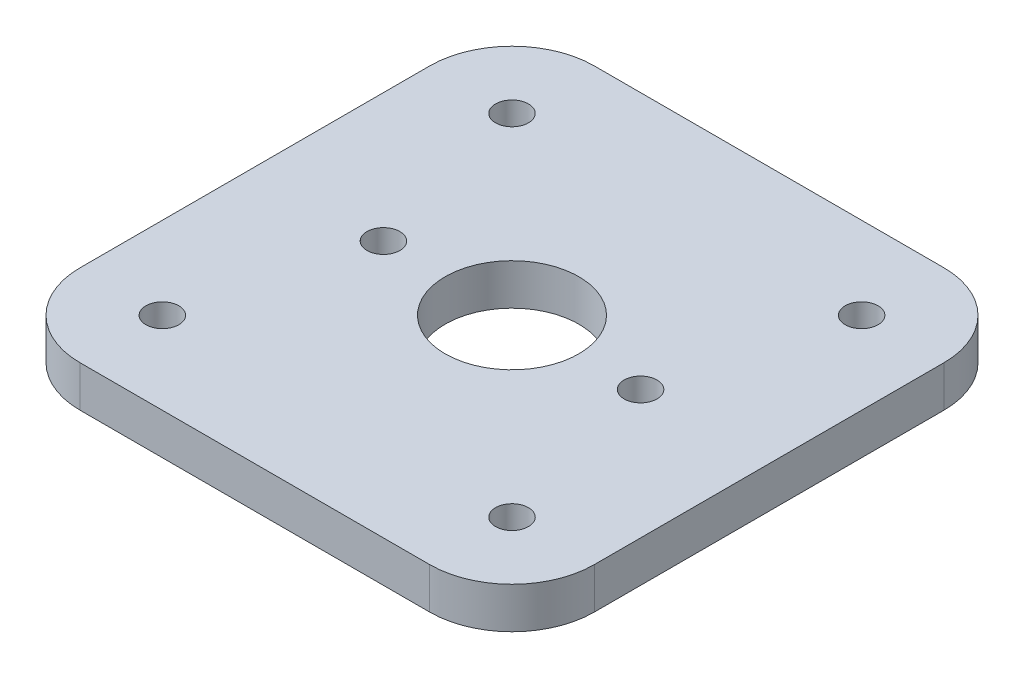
ISO-10303-21;
HEADER;
FILE_DESCRIPTION(('STEP AP214'),'2;1');
FILE_NAME('part.step','',(''),(''),'','','');
FILE_SCHEMA(('AUTOMOTIVE_DESIGN { 1 0 10303 214 1 1 1 1 }'));
ENDSEC;
DATA;
#1=APPLICATION_CONTEXT('core data for automotive mechanical design processes');
#2=APPLICATION_PROTOCOL_DEFINITION('international standard','automotive_design',2000,#1);
#3=PRODUCT_CONTEXT('',#1,'mechanical');
#4=PRODUCT('Part','Part','',(#3));
#5=PRODUCT_RELATED_PRODUCT_CATEGORY('part','',(#4));
#6=PRODUCT_DEFINITION_FORMATION('','',#4);
#7=PRODUCT_DEFINITION_CONTEXT('part definition',#1,'design');
#8=PRODUCT_DEFINITION('design','',#6,#7);
#9=PRODUCT_DEFINITION_SHAPE('','',#8);
#10=(LENGTH_UNIT() NAMED_UNIT(*) SI_UNIT(.MILLI.,.METRE.));
#11=(NAMED_UNIT(*) PLANE_ANGLE_UNIT() SI_UNIT($,.RADIAN.));
#12=(NAMED_UNIT(*) SI_UNIT($,.STERADIAN.) SOLID_ANGLE_UNIT());
#13=UNCERTAINTY_MEASURE_WITH_UNIT(LENGTH_MEASURE(1.E-05),#10,'distance_accuracy_value','');
#14=(GEOMETRIC_REPRESENTATION_CONTEXT(3) GLOBAL_UNCERTAINTY_ASSIGNED_CONTEXT((#13)) GLOBAL_UNIT_ASSIGNED_CONTEXT((#10,
#11,#12)) REPRESENTATION_CONTEXT('',''));
#15=CARTESIAN_POINT('',(0.,0.,0.));
#16=DIRECTION('',(0.,0.,1.));
#17=DIRECTION('',(1.,0.,0.));
#18=AXIS2_PLACEMENT_3D('',#15,#16,#17);
#19=CARTESIAN_POINT('',(-17.,4.,17.));
#20=DIRECTION('',(0.,1.,0.));
#21=DIRECTION('',(0.,0.,1.));
#22=AXIS2_PLACEMENT_3D('',#19,#20,#21);
#23=PLANE('',#22);
#24=CARTESIAN_POINT('',(-17.,4.,17.));
#25=DIRECTION('',(0.,1.,0.));
#26=DIRECTION('',(0.,0.,-1.));
#27=AXIS2_PLACEMENT_3D('',#24,#25,#26);
#28=CIRCLE('',#27,1.59999999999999);
#29=CARTESIAN_POINT('',(-17.,4.,15.4));
#30=VERTEX_POINT('',#29);
#31=EDGE_CURVE('E206',#30,#30,#28,.T.);
#32=ORIENTED_EDGE('',*,*,#31,.F.);
#33=EDGE_LOOP('',(#32));
#34=FACE_BOUND('',#33,.T.);
#35=CARTESIAN_POINT('',(-17.,4.,-17.));
#36=DIRECTION('',(0.,1.,0.));
#37=DIRECTION('',(0.,0.,1.));
#38=AXIS2_PLACEMENT_3D('',#35,#36,#37);
#39=CIRCLE('',#38,1.6);
#40=CARTESIAN_POINT('',(-17.,4.,-15.4));
#41=VERTEX_POINT('',#40);
#42=EDGE_CURVE('E194',#41,#41,#39,.T.);
#43=ORIENTED_EDGE('',*,*,#42,.F.);
#44=EDGE_LOOP('',(#43));
#45=FACE_BOUND('',#44,.T.);
#46=CARTESIAN_POINT('',(-12.5,4.,0.));
#47=DIRECTION('',(0.,1.,0.));
#48=DIRECTION('',(0.,0.,1.));
#49=AXIS2_PLACEMENT_3D('',#46,#47,#48);
#50=CIRCLE('',#49,1.6);
#51=CARTESIAN_POINT('',(-12.5,4.,1.6));
#52=VERTEX_POINT('',#51);
#53=EDGE_CURVE('E182',#52,#52,#50,.T.);
#54=ORIENTED_EDGE('',*,*,#53,.F.);
#55=EDGE_LOOP('',(#54));
#56=FACE_BOUND('',#55,.T.);
#57=CARTESIAN_POINT('',(-17.,4.,17.));
#58=DIRECTION('',(0.,1.,0.));
#59=DIRECTION('',(0.,0.,1.));
#60=AXIS2_PLACEMENT_3D('',#57,#58,#59);
#61=CIRCLE('',#60,8.);
#62=CARTESIAN_POINT('',(-25.,4.,17.));
#63=VERTEX_POINT('',#62);
#64=CARTESIAN_POINT('',(-17.,4.,25.));
#65=VERTEX_POINT('',#64);
#66=EDGE_CURVE('E145',#63,#65,#61,.T.);
#67=ORIENTED_EDGE('',*,*,#66,.T.);
#68=DIRECTION('',(1.,0.,0.));
#69=VECTOR('',#68,1.);
#70=CARTESIAN_POINT('',(-17.,4.,25.));
#71=LINE('',#70,#69);
#72=CARTESIAN_POINT('',(17.,4.,25.));
#73=VERTEX_POINT('',#72);
#74=EDGE_CURVE('E93',#65,#73,#71,.T.);
#75=ORIENTED_EDGE('',*,*,#74,.T.);
#76=CARTESIAN_POINT('',(17.,4.,17.));
#77=DIRECTION('',(0.,1.,0.));
#78=DIRECTION('',(0.,0.,1.));
#79=AXIS2_PLACEMENT_3D('',#76,#77,#78);
#80=CIRCLE('',#79,8.);
#81=CARTESIAN_POINT('',(25.,4.,17.));
#82=VERTEX_POINT('',#81);
#83=EDGE_CURVE('E160',#73,#82,#80,.T.);
#84=ORIENTED_EDGE('',*,*,#83,.T.);
#85=DIRECTION('',(0.,0.,-1.));
#86=VECTOR('',#85,1.);
#87=CARTESIAN_POINT('',(25.,4.,-17.));
#88=LINE('',#87,#86);
#89=CARTESIAN_POINT('',(25.,4.,-17.));
#90=VERTEX_POINT('',#89);
#91=EDGE_CURVE('E173',#82,#90,#88,.T.);
#92=ORIENTED_EDGE('',*,*,#91,.T.);
#93=CARTESIAN_POINT('',(17.,4.,-17.));
#94=DIRECTION('',(0.,1.,0.));
#95=DIRECTION('',(0.,0.,-1.));
#96=AXIS2_PLACEMENT_3D('',#93,#94,#95);
#97=CIRCLE('',#96,8.);
#98=CARTESIAN_POINT('',(17.,4.,-25.));
#99=VERTEX_POINT('',#98);
#100=EDGE_CURVE('E112',#90,#99,#97,.T.);
#101=ORIENTED_EDGE('',*,*,#100,.T.);
#102=DIRECTION('',(-1.,0.,0.));
#103=VECTOR('',#102,1.);
#104=CARTESIAN_POINT('',(-17.,4.,-25.));
#105=LINE('',#104,#103);
#106=CARTESIAN_POINT('',(-17.,4.,-25.));
#107=VERTEX_POINT('',#106);
#108=EDGE_CURVE('E106',#99,#107,#105,.T.);
#109=ORIENTED_EDGE('',*,*,#108,.T.);
#110=CARTESIAN_POINT('',(-17.,4.,-17.));
#111=DIRECTION('',(0.,1.,0.));
#112=DIRECTION('',(0.,0.,1.));
#113=AXIS2_PLACEMENT_3D('',#110,#111,#112);
#114=CIRCLE('',#113,8.);
#115=CARTESIAN_POINT('',(-25.,4.,-17.));
#116=VERTEX_POINT('',#115);
#117=EDGE_CURVE('E110',#107,#116,#114,.T.);
#118=ORIENTED_EDGE('',*,*,#117,.T.);
#119=DIRECTION('',(0.,0.,1.));
#120=VECTOR('',#119,1.);
#121=CARTESIAN_POINT('',(-25.,4.,-17.));
#122=LINE('',#121,#120);
#123=EDGE_CURVE('E50',#116,#63,#122,.T.);
#124=ORIENTED_EDGE('',*,*,#123,.T.);
#125=EDGE_LOOP('',(#67,#75,#84,#92,#101,#109,#118,#124));
#126=FACE_BOUND('',#125,.T.);
#127=CARTESIAN_POINT('',(0.,4.,0.));
#128=DIRECTION('',(0.,1.,0.));
#129=DIRECTION('',(0.,0.,1.));
#130=AXIS2_PLACEMENT_3D('',#127,#128,#129);
#131=CIRCLE('',#130,6.5);
#132=CARTESIAN_POINT('',(0.,4.,6.5));
#133=VERTEX_POINT('',#132);
#134=EDGE_CURVE('E134',#133,#133,#131,.T.);
#135=ORIENTED_EDGE('',*,*,#134,.F.);
#136=EDGE_LOOP('',(#135));
#137=FACE_BOUND('',#136,.T.);
#138=CARTESIAN_POINT('',(12.5,4.,0.));
#139=DIRECTION('',(0.,1.,0.));
#140=DIRECTION('',(0.,0.,-1.));
#141=AXIS2_PLACEMENT_3D('',#138,#139,#140);
#142=CIRCLE('',#141,1.6);
#143=CARTESIAN_POINT('',(12.5,4.,-1.6));
#144=VERTEX_POINT('',#143);
#145=EDGE_CURVE('E188',#144,#144,#142,.T.);
#146=ORIENTED_EDGE('',*,*,#145,.F.);
#147=EDGE_LOOP('',(#146));
#148=FACE_BOUND('',#147,.T.);
#149=CARTESIAN_POINT('',(17.,4.,-17.));
#150=DIRECTION('',(0.,1.,0.));
#151=DIRECTION('',(0.,0.,-1.));
#152=AXIS2_PLACEMENT_3D('',#149,#150,#151);
#153=CIRCLE('',#152,1.60000000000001);
#154=CARTESIAN_POINT('',(17.,4.,-18.6));
#155=VERTEX_POINT('',#154);
#156=EDGE_CURVE('E200',#155,#155,#153,.T.);
#157=ORIENTED_EDGE('',*,*,#156,.F.);
#158=EDGE_LOOP('',(#157));
#159=FACE_BOUND('',#158,.T.);
#160=CARTESIAN_POINT('',(17.,4.,17.));
#161=DIRECTION('',(0.,1.,0.));
#162=DIRECTION('',(0.,0.,1.));
#163=AXIS2_PLACEMENT_3D('',#160,#161,#162);
#164=CIRCLE('',#163,1.60000000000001);
#165=CARTESIAN_POINT('',(17.,4.,18.6));
#166=VERTEX_POINT('',#165);
#167=EDGE_CURVE('E212',#166,#166,#164,.T.);
#168=ORIENTED_EDGE('',*,*,#167,.F.);
#169=EDGE_LOOP('',(#168));
#170=FACE_BOUND('',#169,.T.);
#171=ADVANCED_FACE('F33',(#34,#45,#56,#126,#137,#148,#159,#170),#23,.T.);
#172=CARTESIAN_POINT('',(-17.,0.,17.));
#173=DIRECTION('',(0.,1.,0.));
#174=DIRECTION('',(0.,0.,1.));
#175=AXIS2_PLACEMENT_3D('',#172,#173,#174);
#176=PLANE('',#175);
#177=CARTESIAN_POINT('',(-17.,0.,17.));
#178=DIRECTION('',(0.,1.,0.));
#179=DIRECTION('',(0.,0.,-1.));
#180=AXIS2_PLACEMENT_3D('',#177,#178,#179);
#181=CIRCLE('',#180,1.59999999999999);
#182=CARTESIAN_POINT('',(-17.,0.,15.4));
#183=VERTEX_POINT('',#182);
#184=EDGE_CURVE('E209',#183,#183,#181,.T.);
#185=ORIENTED_EDGE('',*,*,#184,.T.);
#186=EDGE_LOOP('',(#185));
#187=FACE_BOUND('',#186,.T.);
#188=CARTESIAN_POINT('',(-17.,0.,-17.));
#189=DIRECTION('',(0.,1.,0.));
#190=DIRECTION('',(0.,0.,1.));
#191=AXIS2_PLACEMENT_3D('',#188,#189,#190);
#192=CIRCLE('',#191,1.6);
#193=CARTESIAN_POINT('',(-17.,0.,-15.4));
#194=VERTEX_POINT('',#193);
#195=EDGE_CURVE('E197',#194,#194,#192,.T.);
#196=ORIENTED_EDGE('',*,*,#195,.T.);
#197=EDGE_LOOP('',(#196));
#198=FACE_BOUND('',#197,.T.);
#199=CARTESIAN_POINT('',(-12.5,0.,0.));
#200=DIRECTION('',(0.,1.,0.));
#201=DIRECTION('',(0.,0.,1.));
#202=AXIS2_PLACEMENT_3D('',#199,#200,#201);
#203=CIRCLE('',#202,1.6);
#204=CARTESIAN_POINT('',(-12.5,0.,1.6));
#205=VERTEX_POINT('',#204);
#206=EDGE_CURVE('E185',#205,#205,#203,.T.);
#207=ORIENTED_EDGE('',*,*,#206,.T.);
#208=EDGE_LOOP('',(#207));
#209=FACE_BOUND('',#208,.T.);
#210=CARTESIAN_POINT('',(-17.,0.,17.));
#211=DIRECTION('',(0.,1.,0.));
#212=DIRECTION('',(0.,0.,1.));
#213=AXIS2_PLACEMENT_3D('',#210,#211,#212);
#214=CIRCLE('',#213,8.);
#215=CARTESIAN_POINT('',(-25.,0.,17.));
#216=VERTEX_POINT('',#215);
#217=CARTESIAN_POINT('',(-17.,0.,25.));
#218=VERTEX_POINT('',#217);
#219=EDGE_CURVE('E130',#216,#218,#214,.T.);
#220=ORIENTED_EDGE('',*,*,#219,.F.);
#221=DIRECTION('',(0.,0.,1.));
#222=VECTOR('',#221,1.);
#223=CARTESIAN_POINT('',(-25.,0.,-17.));
#224=LINE('',#223,#222);
#225=CARTESIAN_POINT('',(-25.,0.,-17.));
#226=VERTEX_POINT('',#225);
#227=EDGE_CURVE('E85',#226,#216,#224,.T.);
#228=ORIENTED_EDGE('',*,*,#227,.F.);
#229=CARTESIAN_POINT('',(-17.,0.,-17.));
#230=DIRECTION('',(0.,1.,0.));
#231=DIRECTION('',(0.,0.,1.));
#232=AXIS2_PLACEMENT_3D('',#229,#230,#231);
#233=CIRCLE('',#232,8.);
#234=CARTESIAN_POINT('',(-17.,0.,-25.));
#235=VERTEX_POINT('',#234);
#236=EDGE_CURVE('E79',#235,#226,#233,.T.);
#237=ORIENTED_EDGE('',*,*,#236,.F.);
#238=DIRECTION('',(-1.,0.,0.));
#239=VECTOR('',#238,1.);
#240=CARTESIAN_POINT('',(-17.,0.,-25.));
#241=LINE('',#240,#239);
#242=CARTESIAN_POINT('',(17.,0.,-25.));
#243=VERTEX_POINT('',#242);
#244=EDGE_CURVE('E120',#243,#235,#241,.T.);
#245=ORIENTED_EDGE('',*,*,#244,.F.);
#246=CARTESIAN_POINT('',(17.,0.,-17.));
#247=DIRECTION('',(0.,1.,0.));
#248=DIRECTION('',(0.,0.,-1.));
#249=AXIS2_PLACEMENT_3D('',#246,#247,#248);
#250=CIRCLE('',#249,8.);
#251=CARTESIAN_POINT('',(25.,0.,-17.));
#252=VERTEX_POINT('',#251);
#253=EDGE_CURVE('E140',#252,#243,#250,.T.);
#254=ORIENTED_EDGE('',*,*,#253,.F.);
#255=DIRECTION('',(0.,0.,-1.));
#256=VECTOR('',#255,1.);
#257=CARTESIAN_POINT('',(25.,0.,-17.));
#258=LINE('',#257,#256);
#259=CARTESIAN_POINT('',(25.,0.,17.));
#260=VERTEX_POINT('',#259);
#261=EDGE_CURVE('E138',#260,#252,#258,.T.);
#262=ORIENTED_EDGE('',*,*,#261,.F.);
#263=CARTESIAN_POINT('',(17.,0.,17.));
#264=DIRECTION('',(0.,1.,0.));
#265=DIRECTION('',(0.,0.,1.));
#266=AXIS2_PLACEMENT_3D('',#263,#264,#265);
#267=CIRCLE('',#266,8.);
#268=CARTESIAN_POINT('',(17.,0.,25.));
#269=VERTEX_POINT('',#268);
#270=EDGE_CURVE('E136',#269,#260,#267,.T.);
#271=ORIENTED_EDGE('',*,*,#270,.F.);
#272=DIRECTION('',(1.,0.,0.));
#273=VECTOR('',#272,1.);
#274=CARTESIAN_POINT('',(-17.,0.,25.));
#275=LINE('',#274,#273);
#276=EDGE_CURVE('E133',#218,#269,#275,.T.);
#277=ORIENTED_EDGE('',*,*,#276,.F.);
#278=EDGE_LOOP('',(#220,#228,#237,#245,#254,#262,#271,#277));
#279=FACE_BOUND('',#278,.T.);
#280=CARTESIAN_POINT('',(0.,0.,0.));
#281=DIRECTION('',(0.,1.,0.));
#282=DIRECTION('',(0.,0.,1.));
#283=AXIS2_PLACEMENT_3D('',#280,#281,#282);
#284=CIRCLE('',#283,6.5);
#285=CARTESIAN_POINT('',(0.,0.,6.5));
#286=VERTEX_POINT('',#285);
#287=EDGE_CURVE('E179',#286,#286,#284,.T.);
#288=ORIENTED_EDGE('',*,*,#287,.T.);
#289=EDGE_LOOP('',(#288));
#290=FACE_BOUND('',#289,.T.);
#291=CARTESIAN_POINT('',(12.5,0.,0.));
#292=DIRECTION('',(0.,1.,0.));
#293=DIRECTION('',(0.,0.,-1.));
#294=AXIS2_PLACEMENT_3D('',#291,#292,#293);
#295=CIRCLE('',#294,1.6);
#296=CARTESIAN_POINT('',(12.5,0.,-1.6));
#297=VERTEX_POINT('',#296);
#298=EDGE_CURVE('E191',#297,#297,#295,.T.);
#299=ORIENTED_EDGE('',*,*,#298,.T.);
#300=EDGE_LOOP('',(#299));
#301=FACE_BOUND('',#300,.T.);
#302=CARTESIAN_POINT('',(17.,0.,-17.));
#303=DIRECTION('',(0.,1.,0.));
#304=DIRECTION('',(0.,0.,-1.));
#305=AXIS2_PLACEMENT_3D('',#302,#303,#304);
#306=CIRCLE('',#305,1.60000000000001);
#307=CARTESIAN_POINT('',(17.,0.,-18.6));
#308=VERTEX_POINT('',#307);
#309=EDGE_CURVE('E203',#308,#308,#306,.T.);
#310=ORIENTED_EDGE('',*,*,#309,.T.);
#311=EDGE_LOOP('',(#310));
#312=FACE_BOUND('',#311,.T.);
#313=CARTESIAN_POINT('',(17.,0.,17.));
#314=DIRECTION('',(0.,1.,0.));
#315=DIRECTION('',(0.,0.,1.));
#316=AXIS2_PLACEMENT_3D('',#313,#314,#315);
#317=CIRCLE('',#316,1.60000000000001);
#318=CARTESIAN_POINT('',(17.,0.,18.6));
#319=VERTEX_POINT('',#318);
#320=EDGE_CURVE('E215',#319,#319,#317,.T.);
#321=ORIENTED_EDGE('',*,*,#320,.T.);
#322=EDGE_LOOP('',(#321));
#323=FACE_BOUND('',#322,.T.);
#324=ADVANCED_FACE('F164',(#187,#198,#209,#279,#290,#301,#312,#323),#176,.F.);
#325=CARTESIAN_POINT('',(-17.,4.,17.));
#326=DIRECTION('',(0.,-1.,0.));
#327=DIRECTION('',(0.,0.,-1.));
#328=AXIS2_PLACEMENT_3D('',#325,#326,#327);
#329=CYLINDRICAL_SURFACE('',#328,8.);
#330=ORIENTED_EDGE('',*,*,#219,.T.);
#331=DIRECTION('',(0.,-1.,0.));
#332=VECTOR('',#331,1.);
#333=CARTESIAN_POINT('',(-17.,4.,25.));
#334=LINE('',#333,#332);
#335=EDGE_CURVE('E11',#65,#218,#334,.T.);
#336=ORIENTED_EDGE('',*,*,#335,.F.);
#337=ORIENTED_EDGE('',*,*,#66,.F.);
#338=DIRECTION('',(0.,-1.,0.));
#339=VECTOR('',#338,1.);
#340=CARTESIAN_POINT('',(-25.,4.,17.));
#341=LINE('',#340,#339);
#342=EDGE_CURVE('E126',#63,#216,#341,.T.);
#343=ORIENTED_EDGE('',*,*,#342,.T.);
#344=EDGE_LOOP('',(#330,#336,#337,#343));
#345=FACE_BOUND('',#344,.T.);
#346=ADVANCED_FACE('F35',(#345),#329,.T.);
#347=CARTESIAN_POINT('',(-17.,4.,25.));
#348=DIRECTION('',(0.,0.,-1.));
#349=DIRECTION('',(-1.,0.,0.));
#350=AXIS2_PLACEMENT_3D('',#347,#348,#349);
#351=PLANE('',#350);
#352=ORIENTED_EDGE('',*,*,#276,.T.);
#353=DIRECTION('',(0.,-1.,0.));
#354=VECTOR('',#353,1.);
#355=CARTESIAN_POINT('',(17.,4.,25.));
#356=LINE('',#355,#354);
#357=EDGE_CURVE('E42',#73,#269,#356,.T.);
#358=ORIENTED_EDGE('',*,*,#357,.F.);
#359=ORIENTED_EDGE('',*,*,#74,.F.);
#360=ORIENTED_EDGE('',*,*,#335,.T.);
#361=EDGE_LOOP('',(#352,#358,#359,#360));
#362=FACE_BOUND('',#361,.T.);
#363=ADVANCED_FACE('F250',(#362),#351,.F.);
#364=CARTESIAN_POINT('',(17.,4.,17.));
#365=DIRECTION('',(0.,-1.,0.));
#366=DIRECTION('',(0.,0.,-1.));
#367=AXIS2_PLACEMENT_3D('',#364,#365,#366);
#368=CYLINDRICAL_SURFACE('',#367,8.);
#369=ORIENTED_EDGE('',*,*,#270,.T.);
#370=DIRECTION('',(0.,-1.,0.));
#371=VECTOR('',#370,1.);
#372=CARTESIAN_POINT('',(25.,4.,17.));
#373=LINE('',#372,#371);
#374=EDGE_CURVE('E152',#82,#260,#373,.T.);
#375=ORIENTED_EDGE('',*,*,#374,.F.);
#376=ORIENTED_EDGE('',*,*,#83,.F.);
#377=ORIENTED_EDGE('',*,*,#357,.T.);
#378=EDGE_LOOP('',(#369,#375,#376,#377));
#379=FACE_BOUND('',#378,.T.);
#380=ADVANCED_FACE('F158',(#379),#368,.T.);
#381=CARTESIAN_POINT('',(25.,4.,-17.));
#382=DIRECTION('',(-1.,0.,0.));
#383=DIRECTION('',(0.,0.,1.));
#384=AXIS2_PLACEMENT_3D('',#381,#382,#383);
#385=PLANE('',#384);
#386=ORIENTED_EDGE('',*,*,#261,.T.);
#387=DIRECTION('',(0.,-1.,0.));
#388=VECTOR('',#387,1.);
#389=CARTESIAN_POINT('',(25.,4.,-17.));
#390=LINE('',#389,#388);
#391=EDGE_CURVE('E149',#90,#252,#390,.T.);
#392=ORIENTED_EDGE('',*,*,#391,.F.);
#393=ORIENTED_EDGE('',*,*,#91,.F.);
#394=ORIENTED_EDGE('',*,*,#374,.T.);
#395=EDGE_LOOP('',(#386,#392,#393,#394));
#396=FACE_BOUND('',#395,.T.);
#397=ADVANCED_FACE('F169',(#396),#385,.F.);
#398=CARTESIAN_POINT('',(17.,4.,-17.));
#399=DIRECTION('',(0.,-1.,0.));
#400=DIRECTION('',(0.,0.,-1.));
#401=AXIS2_PLACEMENT_3D('',#398,#399,#400);
#402=CYLINDRICAL_SURFACE('',#401,8.);
#403=ORIENTED_EDGE('',*,*,#253,.T.);
#404=DIRECTION('',(0.,-1.,0.));
#405=VECTOR('',#404,1.);
#406=CARTESIAN_POINT('',(17.,4.,-25.));
#407=LINE('',#406,#405);
#408=EDGE_CURVE('E121',#99,#243,#407,.T.);
#409=ORIENTED_EDGE('',*,*,#408,.F.);
#410=ORIENTED_EDGE('',*,*,#100,.F.);
#411=ORIENTED_EDGE('',*,*,#391,.T.);
#412=EDGE_LOOP('',(#403,#409,#410,#411));
#413=FACE_BOUND('',#412,.T.);
#414=ADVANCED_FACE('F172',(#413),#402,.T.);
#415=CARTESIAN_POINT('',(-17.,4.,-25.));
#416=DIRECTION('',(0.,0.,1.));
#417=DIRECTION('',(1.,0.,0.));
#418=AXIS2_PLACEMENT_3D('',#415,#416,#417);
#419=PLANE('',#418);
#420=ORIENTED_EDGE('',*,*,#244,.T.);
#421=DIRECTION('',(0.,-1.,0.));
#422=VECTOR('',#421,1.);
#423=CARTESIAN_POINT('',(-17.,4.,-25.));
#424=LINE('',#423,#422);
#425=EDGE_CURVE('E117',#107,#235,#424,.T.);
#426=ORIENTED_EDGE('',*,*,#425,.F.);
#427=ORIENTED_EDGE('',*,*,#108,.F.);
#428=ORIENTED_EDGE('',*,*,#408,.T.);
#429=EDGE_LOOP('',(#420,#426,#427,#428));
#430=FACE_BOUND('',#429,.T.);
#431=ADVANCED_FACE('F118',(#430),#419,.F.);
#432=CARTESIAN_POINT('',(-17.,4.,-17.));
#433=DIRECTION('',(0.,-1.,0.));
#434=DIRECTION('',(0.,0.,-1.));
#435=AXIS2_PLACEMENT_3D('',#432,#433,#434);
#436=CYLINDRICAL_SURFACE('',#435,8.);
#437=ORIENTED_EDGE('',*,*,#236,.T.);
#438=DIRECTION('',(0.,-1.,0.));
#439=VECTOR('',#438,1.);
#440=CARTESIAN_POINT('',(-25.,4.,-17.));
#441=LINE('',#440,#439);
#442=EDGE_CURVE('E122',#116,#226,#441,.T.);
#443=ORIENTED_EDGE('',*,*,#442,.F.);
#444=ORIENTED_EDGE('',*,*,#117,.F.);
#445=ORIENTED_EDGE('',*,*,#425,.T.);
#446=EDGE_LOOP('',(#437,#443,#444,#445));
#447=FACE_BOUND('',#446,.T.);
#448=ADVANCED_FACE('F124',(#447),#436,.T.);
#449=CARTESIAN_POINT('',(-25.,4.,-17.));
#450=DIRECTION('',(1.,0.,0.));
#451=DIRECTION('',(0.,0.,-1.));
#452=AXIS2_PLACEMENT_3D('',#449,#450,#451);
#453=PLANE('',#452);
#454=ORIENTED_EDGE('',*,*,#227,.T.);
#455=ORIENTED_EDGE('',*,*,#342,.F.);
#456=ORIENTED_EDGE('',*,*,#123,.F.);
#457=ORIENTED_EDGE('',*,*,#442,.T.);
#458=EDGE_LOOP('',(#454,#455,#456,#457));
#459=FACE_BOUND('',#458,.T.);
#460=ADVANCED_FACE('F238',(#459),#453,.F.);
#461=CARTESIAN_POINT('',(0.,4.,0.));
#462=DIRECTION('',(0.,-1.,0.));
#463=DIRECTION('',(0.,0.,-1.));
#464=AXIS2_PLACEMENT_3D('',#461,#462,#463);
#465=CYLINDRICAL_SURFACE('',#464,6.5);
#466=ORIENTED_EDGE('',*,*,#134,.T.);
#467=EDGE_LOOP('',(#466));
#468=FACE_BOUND('',#467,.T.);
#469=ORIENTED_EDGE('',*,*,#287,.F.);
#470=EDGE_LOOP('',(#469));
#471=FACE_BOUND('',#470,.T.);
#472=ADVANCED_FACE('F235',(#468,#471),#465,.F.);
#473=CARTESIAN_POINT('',(-12.5,4.,0.));
#474=DIRECTION('',(0.,-1.,0.));
#475=DIRECTION('',(0.,0.,-1.));
#476=AXIS2_PLACEMENT_3D('',#473,#474,#475);
#477=CYLINDRICAL_SURFACE('',#476,1.6);
#478=ORIENTED_EDGE('',*,*,#53,.T.);
#479=EDGE_LOOP('',(#478));
#480=FACE_BOUND('',#479,.T.);
#481=ORIENTED_EDGE('',*,*,#206,.F.);
#482=EDGE_LOOP('',(#481));
#483=FACE_BOUND('',#482,.T.);
#484=ADVANCED_FACE('F314',(#480,#483),#477,.F.);
#485=CARTESIAN_POINT('',(12.5,4.,0.));
#486=DIRECTION('',(0.,-1.,0.));
#487=DIRECTION('',(0.,0.,-1.));
#488=AXIS2_PLACEMENT_3D('',#485,#486,#487);
#489=CYLINDRICAL_SURFACE('',#488,1.6);
#490=ORIENTED_EDGE('',*,*,#145,.T.);
#491=EDGE_LOOP('',(#490));
#492=FACE_BOUND('',#491,.T.);
#493=ORIENTED_EDGE('',*,*,#298,.F.);
#494=EDGE_LOOP('',(#493));
#495=FACE_BOUND('',#494,.T.);
#496=ADVANCED_FACE('F322',(#492,#495),#489,.F.);
#497=CARTESIAN_POINT('',(-17.,4.,-17.));
#498=DIRECTION('',(0.,-1.,0.));
#499=DIRECTION('',(0.,0.,-1.));
#500=AXIS2_PLACEMENT_3D('',#497,#498,#499);
#501=CYLINDRICAL_SURFACE('',#500,1.6);
#502=ORIENTED_EDGE('',*,*,#42,.T.);
#503=EDGE_LOOP('',(#502));
#504=FACE_BOUND('',#503,.T.);
#505=ORIENTED_EDGE('',*,*,#195,.F.);
#506=EDGE_LOOP('',(#505));
#507=FACE_BOUND('',#506,.T.);
#508=ADVANCED_FACE('F330',(#504,#507),#501,.F.);
#509=CARTESIAN_POINT('',(17.,4.,-17.));
#510=DIRECTION('',(0.,-1.,0.));
#511=DIRECTION('',(0.,0.,-1.));
#512=AXIS2_PLACEMENT_3D('',#509,#510,#511);
#513=CYLINDRICAL_SURFACE('',#512,1.60000000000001);
#514=ORIENTED_EDGE('',*,*,#156,.T.);
#515=EDGE_LOOP('',(#514));
#516=FACE_BOUND('',#515,.T.);
#517=ORIENTED_EDGE('',*,*,#309,.F.);
#518=EDGE_LOOP('',(#517));
#519=FACE_BOUND('',#518,.T.);
#520=ADVANCED_FACE('F339',(#516,#519),#513,.F.);
#521=CARTESIAN_POINT('',(-17.,4.,17.));
#522=DIRECTION('',(0.,-1.,0.));
#523=DIRECTION('',(0.,0.,-1.));
#524=AXIS2_PLACEMENT_3D('',#521,#522,#523);
#525=CYLINDRICAL_SURFACE('',#524,1.59999999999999);
#526=ORIENTED_EDGE('',*,*,#31,.T.);
#527=EDGE_LOOP('',(#526));
#528=FACE_BOUND('',#527,.T.);
#529=ORIENTED_EDGE('',*,*,#184,.F.);
#530=EDGE_LOOP('',(#529));
#531=FACE_BOUND('',#530,.T.);
#532=ADVANCED_FACE('F348',(#528,#531),#525,.F.);
#533=CARTESIAN_POINT('',(17.,4.,17.));
#534=DIRECTION('',(0.,-1.,0.));
#535=DIRECTION('',(0.,0.,-1.));
#536=AXIS2_PLACEMENT_3D('',#533,#534,#535);
#537=CYLINDRICAL_SURFACE('',#536,1.60000000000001);
#538=ORIENTED_EDGE('',*,*,#167,.T.);
#539=EDGE_LOOP('',(#538));
#540=FACE_BOUND('',#539,.T.);
#541=ORIENTED_EDGE('',*,*,#320,.F.);
#542=EDGE_LOOP('',(#541));
#543=FACE_BOUND('',#542,.T.);
#544=ADVANCED_FACE('F221',(#540,#543),#537,.F.);
#545=CLOSED_SHELL('',(#171,#324,#346,#363,#380,#397,#414,#431,#448,#460,#472,#484,#496,#508,
#520,#532,#544));
#546=MANIFOLD_SOLID_BREP('B2',#545);
#547=ADVANCED_BREP_SHAPE_REPRESENTATION('',(#18,#546),#14);
#548=SHAPE_DEFINITION_REPRESENTATION(#9,#547);
ENDSEC;
END-ISO-10303-21;
